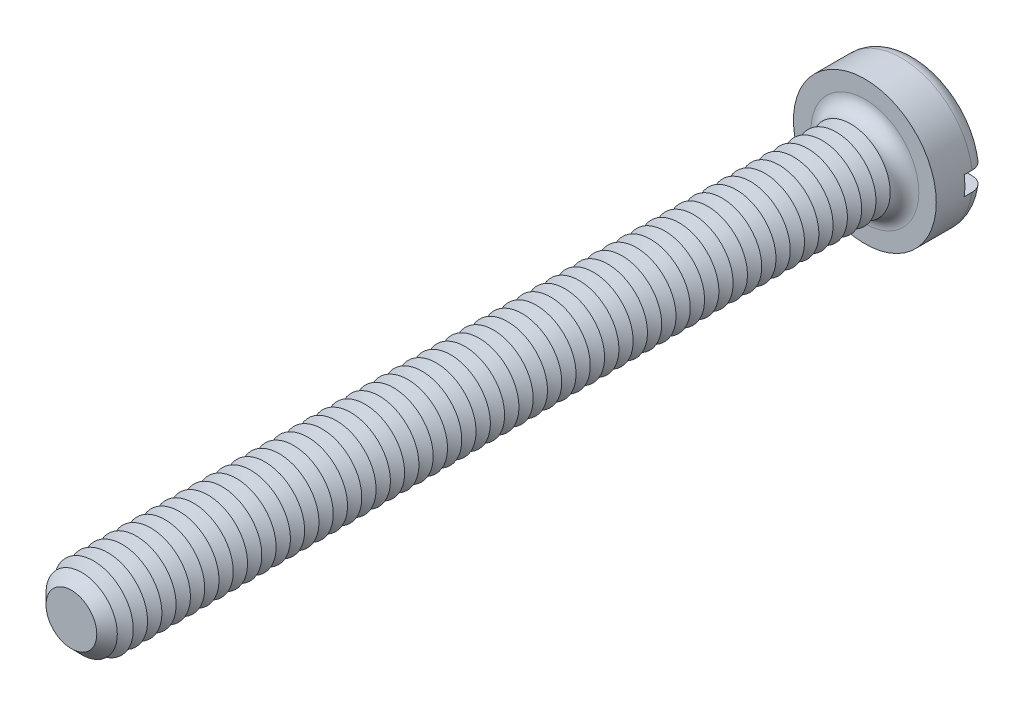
from build123d import *

# Parameters (mm, degrees)
SKETCH3_R           = 2.25
BOSS_EXTRUDE2_DEPTH = 1.6
SKETCH4_R           = 1.25
BOSS_EXTRUDE3_DEPTH = 25
FILLET1_R           = 0.45
CHAMFER1_SIZE       = 0.45
LPATTERN1_COUNT     = 54
LPATTERN1_PITCH     = 0.45
SKETCH8_W           = 4.5
SKETCH8_H           = 0.6
CUT_EXTRUDE1_DEPTH  = 0.7


with BuildPart() as part:
    # Sketch3 → Boss-Extrude2 (new body)
    with BuildSketch(Plane.XY):
        Circle(SKETCH3_R)
    extrude(amount=-BOSS_EXTRUDE2_DEPTH)

    # Sketch4 → Boss-Extrude3 (add)
    with BuildSketch(Plane.XY):
        Circle(SKETCH4_R)
    extrude(amount=BOSS_EXTRUDE3_DEPTH)

    # Fillet1
    fillet1_edges = [part.edges().sort_by_distance(p)[0] for p in [
        (-2.25, 0, -1.6),
        (-1.25, 0, 0),
    ]]
    fillet(fillet1_edges, radius=FILLET1_R)

    # Chamfer1
    chamfer1_edges = [part.edges().sort_by_distance(p)[0] for p in [
        (-1.25, 0, 25),
    ]]
    chamfer(chamfer1_edges, length=CHAMFER1_SIZE)

    # Sketch6 → Cut-Revolve1 (revolve, cut)
    with BuildSketch(Plane(origin=(0, 0, 0), x_dir=(0, 0, -1), z_dir=(1, 0, 0)), mode=Mode.PRIVATE) as cut_revolve1_sk:
        Polygon((-0.45, 1.25), (-0.675, 0.860288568), (-0.9, 1.25), align=None)
    cut_revolve1 = revolve(cut_revolve1_sk.sketch.rotate(Axis((0, 0, -1.694361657), (0, 0, 1)), 90), axis=Axis((0, 0, -1.694361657), (0, 0, 1)), mode=Mode.SUBTRACT)

    # LPattern1: Cut-Revolve1 ×54
    with Locations(*[(0, 0, i * LPATTERN1_PITCH) for i in range(1, LPATTERN1_COUNT)]):
        add(cut_revolve1, mode=Mode.SUBTRACT)

    # Sketch8 → Cut-Extrude1 (cut)
    with BuildSketch(Plane(origin=(0, 0, -1.6), x_dir=(-1, 0, 0), z_dir=(0, 0, -1))):
        Rectangle(SKETCH8_W, SKETCH8_H)
    extrude(amount=-CUT_EXTRUDE1_DEPTH, mode=Mode.SUBTRACT)


solid = part.part
